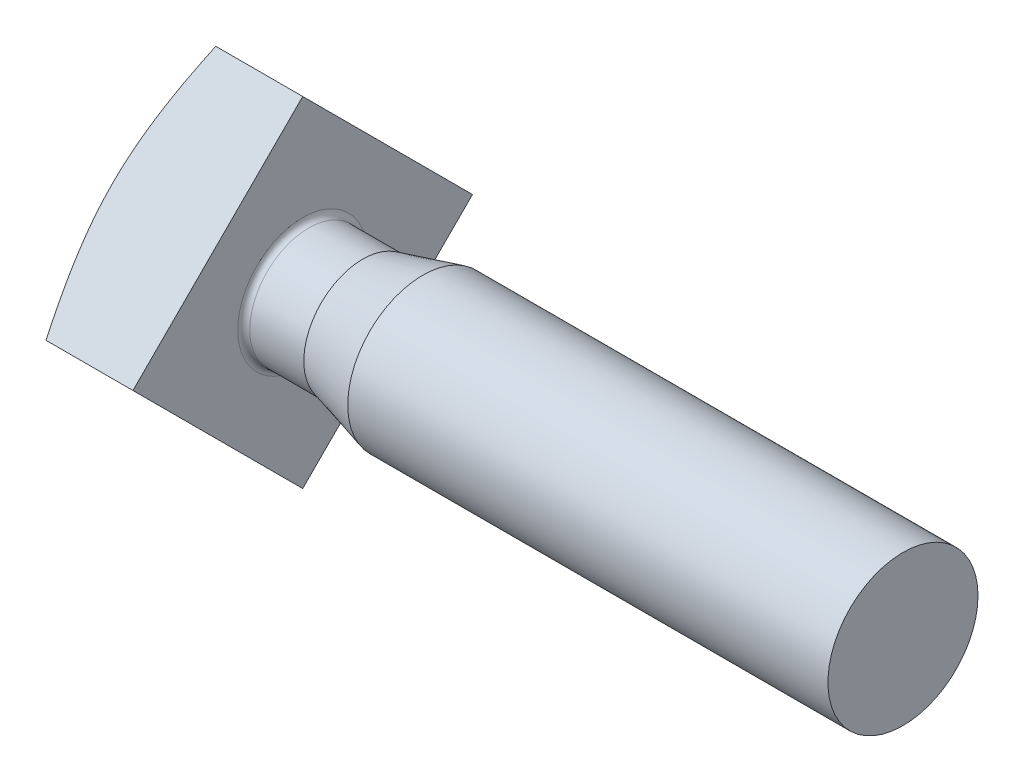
from build123d import *

# Parameters (mm, degrees)
BASEHEAD_DEPTH     = 3.5
SKETCH3_R          = 2.5
BASEBODY_DEPTH     = 20
SKETCH5_R          = 3.6
CUT_EXTRUDE1_DEPTH = 0.7
HEADFILLET1_R      = 0.2


with BuildPart() as part:
    # Sketch2 → BaseHead (new body)
    with BuildSketch(Plane(origin=(0, 0, 0), x_dir=(0, 0, -1), z_dir=(1, 0, 0))):
        Polygon((5.656854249, 0), (0, 5.656854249), (-5.656854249, 0), (0, -5.656854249), align=None)
    extrude(amount=BASEHEAD_DEPTH)

    # Sketch3 → BaseBody (add)
    with BuildSketch(Plane(origin=(3.5, 0, 0), x_dir=(0, 0, -1), z_dir=(1, 0, 0))):
        with Locations(Location((0, 0, 0), (0, 0, 180))):
            Circle(SKETCH3_R)
    extrude(amount=BASEBODY_DEPTH)

    # Sketch4 → HeadChamfer (revolve, cut)
    with BuildSketch(Plane.XY):
        Polygon((0, 5.656854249), (0.603045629, 5.656854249), (0, 4), align=None)
    revolve(axis=Axis((-0.779828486, 0, 0), (1, 0, 0)), mode=Mode.SUBTRACT)

    # Sketch5 → Cut-Extrude1 (cut)
    with BuildSketch(Plane.ZY):
        Circle(SKETCH5_R)
    extrude(amount=-CUT_EXTRUDE1_DEPTH, mode=Mode.SUBTRACT)

    # Sketch6 → Cut-Revolve1 (revolve, cut)
    with BuildSketch(Plane.XY, mode=Mode.PRIVATE) as cut_revolve1_sk:
        Polygon((3.5, 1.964101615), (5.5, 1.964101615), (7.5, 2.5), (3.5, 2.5), align=None)
    revolve(cut_revolve1_sk.sketch.rotate(Axis((23.5, 0, 0), (-1, 0, 0)), 90), axis=Axis((23.5, 0, 0), (-1, 0, 0)), mode=Mode.SUBTRACT)

    # HeadFillet1
    headfillet1_edges = [part.edges().sort_by_distance(p)[0] for p in [
        (3.5, 0, 1.964101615),
    ]]
    fillet(headfillet1_edges, radius=HEADFILLET1_R)


solid = part.part
